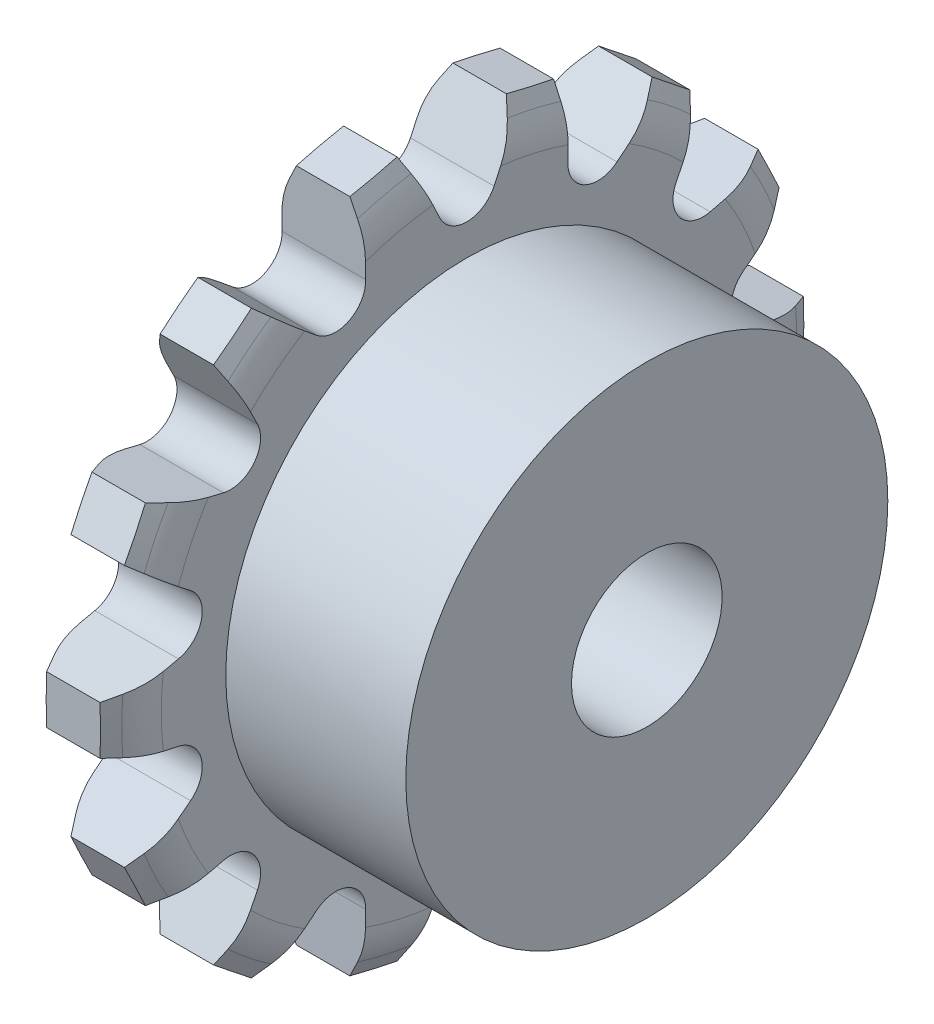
from build123d import *

# Parameters (mm, degrees)
ENL_V_MAT_EXTRU_1_DEPTH      = 11.1
ENL_V_MAT_EXTRU_1_DEPTH_BACK = 11.1
ESQUISSE2_R                  = 70.2


with BuildPart() as part:
    # Esquisse1 → R_volution1 (revolve)
    with BuildSketch(Plane.XY, mode=Mode.PRIVATE) as r_volution1_sk:
        with BuildLine():
            Line((0, 40.559844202), (0, 10))
            Line((0, 10), (35, 10))
            Line((35, 10), (35, 32))
            Line((35, 32), (11.1, 32))
            Line((11.1, 32), (11.1, 40.559844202))
            ThreePointArc((11.1, 40.559844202), (10.845318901, 42.744810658), (10.09493086, 44.812625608))
            Line((10.09493086, 44.812625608), (9.1, 46.8))
            Line((9.1, 46.8), (2, 46.8))
            Line((2, 46.8), (1.00506914, 44.812625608))
            ThreePointArc((1.00506914, 44.812625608), (0.254681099, 42.744810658), (0, 40.559844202))
        make_face()
    revolve(r_volution1_sk.sketch.rotate(Axis((35, 0, 0), (-1, 0, 0)), 270), axis=Axis((35, 0, 0), (-1, 0, 0)))

    # Esquisse2 → Enl_v. mat.-Extru.1 (cut, two sides: drawn at the far end of the back side and taken through both)
    with BuildSketch(Plane(origin=(5.55, 0, 0), x_dir=(0, 0, -1), z_dir=(1, 0, 0)).offset(-ENL_V_MAT_EXTRU_1_DEPTH_BACK)):
        Circle(ESQUISSE2_R)
        with BuildLine():
            Line((-46.689438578, 3.215015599), (-46.689438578, -3.215015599))
            Line((-46.689438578, -3.215015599), (-38.282426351, -5.023901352))
            ThreePointArc((-38.282426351, -5.023901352), (-35.22793713, -8.040546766), (-36.671063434, -12.083743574))
            Line((-36.671063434, -12.083743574), (-43.460673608, -17.361159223))
            Line((-43.460673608, -17.361159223), (-40.670787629, -23.154417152))
            Line((-40.670787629, -23.154417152), (-32.311485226, -21.136501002))
            ThreePointArc((-32.311485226, -21.136501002), (-28.250612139, -22.5291114), (-27.796546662, -26.798054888))
            Line((-27.796546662, -26.798054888), (-31.623989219, -34.49874354))
            Line((-31.623989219, -34.49874354), (-26.596788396, -38.507802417))
            Line((-26.596788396, -38.507802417), (-19.940858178, -33.062757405))
            ThreePointArc((-19.940858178, -33.062757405), (-15.677906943, -32.555509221), (-13.416582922, -36.204682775))
            Line((-13.416582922, -36.204682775), (-13.523785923, -44.8034286))
            Line((-13.523785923, -44.8034286), (-7.254969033, -46.234245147))
            Line((-7.254969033, -46.234245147), (-3.620699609, -38.440529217))
            ThreePointArc((-3.620699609, -38.440529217), (0, -36.133889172), (3.620699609, -38.440529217))
            Line((3.620699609, -38.440529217), (7.254969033, -46.234245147))
            Line((7.254969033, -46.234245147), (13.523785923, -44.8034286))
            Line((13.523785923, -44.8034286), (13.416582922, -36.204682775))
            ThreePointArc((13.416582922, -36.204682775), (15.677906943, -32.555509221), (19.940858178, -33.062757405))
            Line((19.940858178, -33.062757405), (26.596788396, -38.507802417))
            Line((26.596788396, -38.507802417), (31.623989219, -34.49874354))
            Line((31.623989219, -34.49874354), (27.796546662, -26.798054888))
            ThreePointArc((27.796546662, -26.798054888), (28.250612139, -22.5291114), (32.311485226, -21.136501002))
            Line((32.311485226, -21.136501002), (40.670787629, -23.154417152))
            Line((40.670787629, -23.154417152), (43.460673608, -17.361159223))
            Line((43.460673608, -17.361159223), (36.671063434, -12.083743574))
            ThreePointArc((36.671063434, -12.083743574), (35.22793713, -8.040546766), (38.282426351, -5.023901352))
            Line((38.282426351, -5.023901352), (46.689438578, -3.215015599))
            Line((46.689438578, -3.215015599), (46.689438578, 3.215015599))
            Line((46.689438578, 3.215015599), (38.282426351, 5.023901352))
            ThreePointArc((38.282426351, 5.023901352), (35.22793713, 8.040546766), (36.671063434, 12.083743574))
            Line((36.671063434, 12.083743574), (43.460673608, 17.361159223))
            Line((43.460673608, 17.361159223), (40.670787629, 23.154417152))
            Line((40.670787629, 23.154417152), (32.311485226, 21.136501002))
            ThreePointArc((32.311485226, 21.136501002), (28.250612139, 22.5291114), (27.796546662, 26.798054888))
            Line((27.796546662, 26.798054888), (31.623989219, 34.49874354))
            Line((31.623989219, 34.49874354), (26.596788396, 38.507802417))
            Line((26.596788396, 38.507802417), (19.940858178, 33.062757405))
            ThreePointArc((19.940858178, 33.062757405), (15.677906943, 32.555509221), (13.416582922, 36.204682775))
            Line((13.416582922, 36.204682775), (13.523785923, 44.8034286))
            Line((13.523785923, 44.8034286), (7.254969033, 46.234245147))
            Line((7.254969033, 46.234245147), (3.620699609, 38.440529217))
            ThreePointArc((3.620699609, 38.440529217), (0, 36.133889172), (-3.620699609, 38.440529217))
            Line((-3.620699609, 38.440529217), (-7.254969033, 46.234245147))
            Line((-7.254969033, 46.234245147), (-13.523785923, 44.8034286))
            Line((-13.523785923, 44.8034286), (-13.416582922, 36.204682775))
            ThreePointArc((-13.416582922, 36.204682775), (-15.677906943, 32.555509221), (-19.940858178, 33.062757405))
            Line((-19.940858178, 33.062757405), (-26.596788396, 38.507802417))
            Line((-26.596788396, 38.507802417), (-31.623989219, 34.49874354))
            Line((-31.623989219, 34.49874354), (-27.796546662, 26.798054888))
            ThreePointArc((-27.796546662, 26.798054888), (-28.250612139, 22.5291114), (-32.311485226, 21.136501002))
            Line((-32.311485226, 21.136501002), (-40.670787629, 23.154417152))
            Line((-40.670787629, 23.154417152), (-43.460673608, 17.361159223))
            Line((-43.460673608, 17.361159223), (-36.671063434, 12.083743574))
            ThreePointArc((-36.671063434, 12.083743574), (-35.22793713, 8.040546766), (-38.282426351, 5.023901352))
            Line((-38.282426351, 5.023901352), (-46.689438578, 3.215015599))
        make_face(mode=Mode.SUBTRACT)
    extrude(amount=ENL_V_MAT_EXTRU_1_DEPTH + ENL_V_MAT_EXTRU_1_DEPTH_BACK, mode=Mode.SUBTRACT)


solid = part.part
